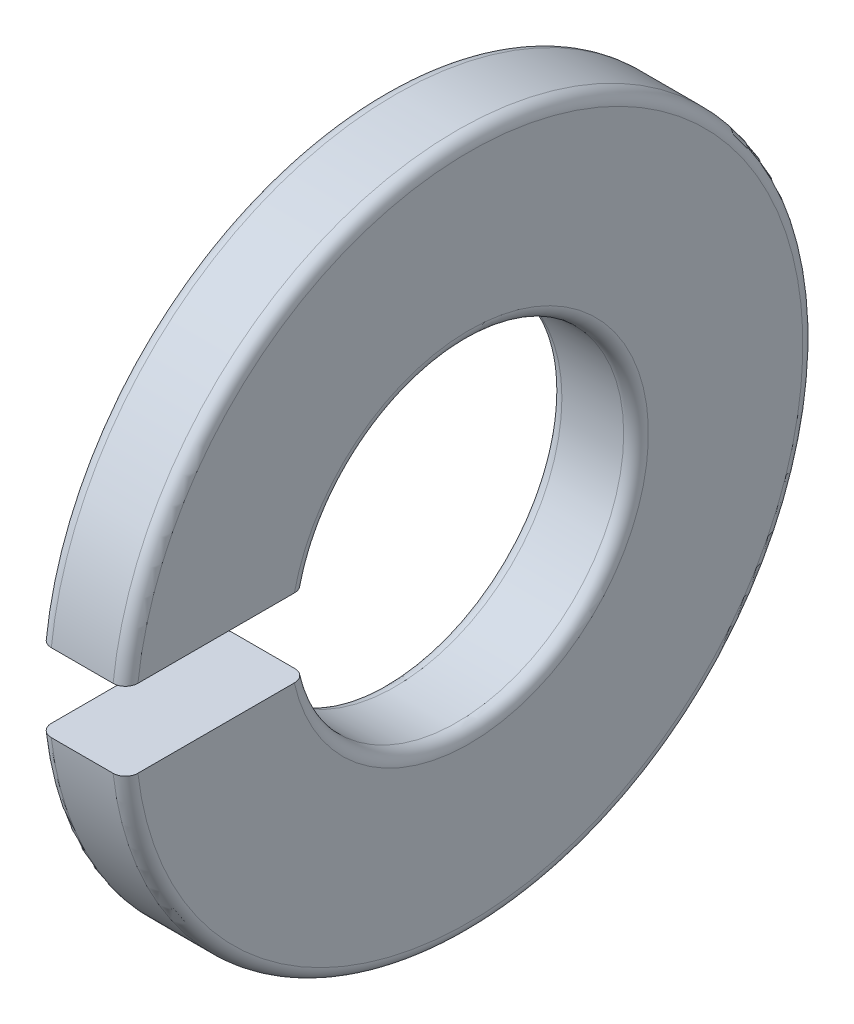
from build123d import *

# Parameters (mm, degrees)
SKETCH2_W = 0.63
SKETCH2_H = 2.856
GAP_DEPTH = 5.021193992


with BuildPart() as part:
    # Sketch1 → Base-Revolve (revolve)
    with BuildSketch(Plane.XY):
        with BuildLine():
            Line((0, 1.45), (0, 2.7))
            ThreePointArc((0, 2.7), (-0.029289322, 2.770710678), (-0.1, 2.8))
            Line((-0.1, 2.8), (-0.6, 2.8))
            ThreePointArc((-0.6, 2.8), (-0.670710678, 2.770710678), (-0.7, 2.7))
            Line((-0.7, 2.7), (-0.7, 1.45))
            ThreePointArc((-0.7, 1.45), (-0.670710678, 1.379289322), (-0.6, 1.35))
            Line((-0.6, 1.35), (-0.1, 1.35))
            ThreePointArc((-0.1, 1.35), (-0.029289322, 1.379289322), (0, 1.45))
        make_face()
    revolve(axis=Axis((-34.925, 0, 0), (1, 0, 0)))

    # Sketch2 → Gap (cut, through all)
    with BuildSketch(Plane(origin=(0, 0, 0), x_dir=(0, -1, 0), z_dir=(-1, 0, 0))):
        with Locations((0, 1.428)):
            Rectangle(SKETCH2_W, SKETCH2_H)
    extrude(amount=GAP_DEPTH, mode=Mode.SUBTRACT)


solid = part.part
